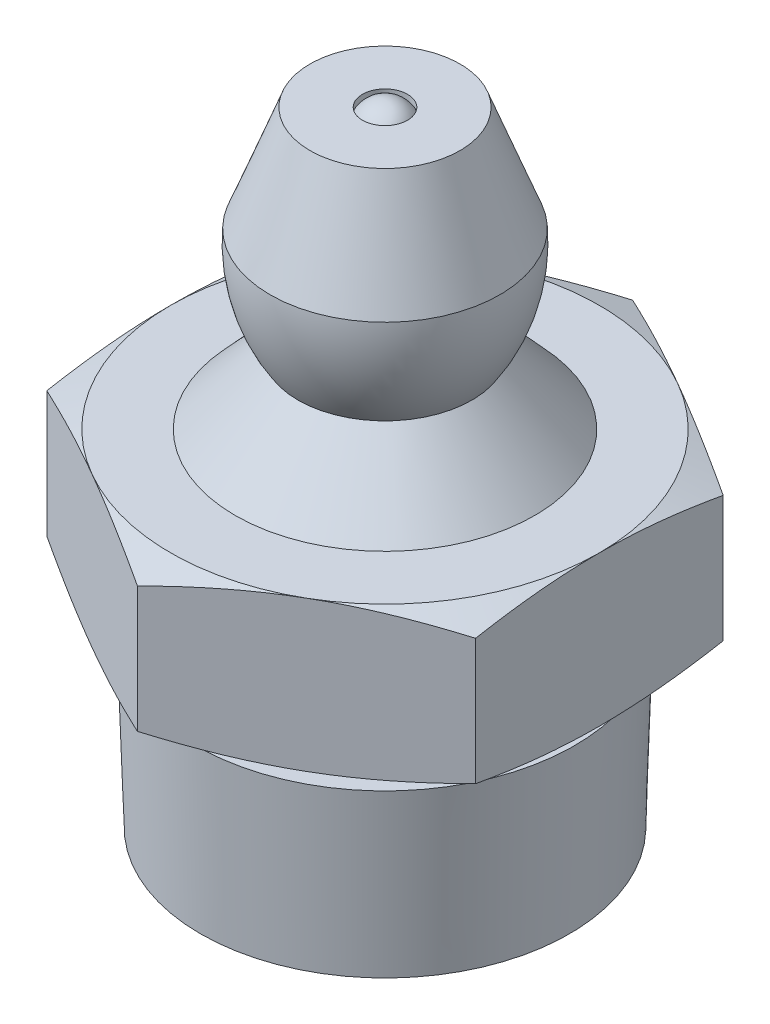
ISO-10303-21;
HEADER;
FILE_DESCRIPTION(('STEP AP214'),'2;1');
FILE_NAME('part.step','',(''),(''),'','','');
FILE_SCHEMA(('AUTOMOTIVE_DESIGN { 1 0 10303 214 1 1 1 1 }'));
ENDSEC;
DATA;
#1=APPLICATION_CONTEXT('core data for automotive mechanical design processes');
#2=APPLICATION_PROTOCOL_DEFINITION('international standard','automotive_design',2000,#1);
#3=PRODUCT_CONTEXT('',#1,'mechanical');
#4=PRODUCT('Part','Part','',(#3));
#5=PRODUCT_RELATED_PRODUCT_CATEGORY('part','',(#4));
#6=PRODUCT_DEFINITION_FORMATION('','',#4);
#7=PRODUCT_DEFINITION_CONTEXT('part definition',#1,'design');
#8=PRODUCT_DEFINITION('design','',#6,#7);
#9=PRODUCT_DEFINITION_SHAPE('','',#8);
#10=(LENGTH_UNIT() NAMED_UNIT(*) SI_UNIT(.MILLI.,.METRE.));
#11=(NAMED_UNIT(*) PLANE_ANGLE_UNIT() SI_UNIT($,.RADIAN.));
#12=(NAMED_UNIT(*) SI_UNIT($,.STERADIAN.) SOLID_ANGLE_UNIT());
#13=UNCERTAINTY_MEASURE_WITH_UNIT(LENGTH_MEASURE(1.E-05),#10,'distance_accuracy_value','');
#14=(GEOMETRIC_REPRESENTATION_CONTEXT(3) GLOBAL_UNCERTAINTY_ASSIGNED_CONTEXT((#13)) GLOBAL_UNIT_ASSIGNED_CONTEXT((#10,
#11,#12)) REPRESENTATION_CONTEXT('',''));
#15=CARTESIAN_POINT('',(0.,0.,0.));
#16=DIRECTION('',(0.,0.,1.));
#17=DIRECTION('',(1.,0.,0.));
#18=AXIS2_PLACEMENT_3D('',#15,#16,#17);
#19=CARTESIAN_POINT('',(0.,-10.,0.));
#20=DIRECTION('',(0.,1.,0.));
#21=DIRECTION('',(1.00000000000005,0.,0.));
#22=AXIS2_PLACEMENT_3D('',#19,#20,#21);
#23=CYLINDRICAL_SURFACE('',#22,0.5775);
#24=CARTESIAN_POINT('',(-2.2135071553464E-12,10.8410653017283,3.46944695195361E-13));
#25=DIRECTION('',(0.,-1.,0.));
#26=DIRECTION('',(0.,0.,-1.00000000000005));
#27=AXIS2_PLACEMENT_3D('',#24,#25,#26);
#28=CIRCLE('',#27,0.5775);
#29=CARTESIAN_POINT('',(-2.2135071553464E-12,10.8410653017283,-0.577499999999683));
#30=VERTEX_POINT('',#29);
#31=EDGE_CURVE('E20',#30,#30,#28,.T.);
#32=ORIENTED_EDGE('',*,*,#31,.T.);
#33=EDGE_LOOP('',(#32));
#34=FACE_BOUND('',#33,.T.);
#35=CARTESIAN_POINT('',(-2.2135071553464E-12,11.,3.46944695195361E-13));
#36=DIRECTION('',(0.,-1.,0.));
#37=DIRECTION('',(1.00000000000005,0.,0.));
#38=AXIS2_PLACEMENT_3D('',#35,#36,#37);
#39=CIRCLE('',#38,0.5775);
#40=CARTESIAN_POINT('',(0.577499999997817,11.,3.46944695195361E-13));
#41=VERTEX_POINT('',#40);
#42=EDGE_CURVE('E283',#41,#41,#39,.T.);
#43=ORIENTED_EDGE('',*,*,#42,.F.);
#44=EDGE_LOOP('',(#43));
#45=FACE_BOUND('',#44,.T.);
#46=ADVANCED_FACE('F16',(#34,#45),#23,.F.);
#47=CARTESIAN_POINT('',(4.73131694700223,-5.,4.83034685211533E-13));
#48=DIRECTION('',(0.,1.,0.));
#49=DIRECTION('',(0.,0.,1.00000000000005));
#50=AXIS2_PLACEMENT_3D('',#47,#48,#49);
#51=PLANE('',#50);
#52=CARTESIAN_POINT('',(0.,-5.,0.));
#53=DIRECTION('',(0.,1.,0.));
#54=DIRECTION('',(0.,0.,1.00000000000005));
#55=AXIS2_PLACEMENT_3D('',#52,#53,#54);
#56=CIRCLE('',#55,0.5775);
#57=CARTESIAN_POINT('',(0.,-5.,0.57750000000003));
#58=VERTEX_POINT('',#57);
#59=EDGE_CURVE('E281',#58,#58,#56,.T.);
#60=ORIENTED_EDGE('',*,*,#59,.T.);
#61=EDGE_LOOP('',(#60));
#62=FACE_BOUND('',#61,.T.);
#63=CARTESIAN_POINT('',(0.,-5.,0.));
#64=DIRECTION('',(0.,-1.,0.));
#65=DIRECTION('',(0.,0.,-1.00000000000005));
#66=AXIS2_PLACEMENT_3D('',#63,#64,#65);
#67=CIRCLE('',#66,4.73131694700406);
#68=CARTESIAN_POINT('',(0.,-5.,-4.7313169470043));
#69=VERTEX_POINT('',#68);
#70=EDGE_CURVE('E326',#69,#69,#67,.T.);
#71=ORIENTED_EDGE('',*,*,#70,.T.);
#72=EDGE_LOOP('',(#71));
#73=FACE_BOUND('',#72,.T.);
#74=ADVANCED_FACE('F18',(#62,#73),#51,.F.);
#75=CARTESIAN_POINT('',(0.,0.,0.));
#76=DIRECTION('',(0.,-1.,0.));
#77=DIRECTION('',(0.,0.,-1.00000000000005));
#78=AXIS2_PLACEMENT_3D('',#75,#76,#77);
#79=CYLINDRICAL_SURFACE('',#78,4.3776);
#80=CARTESIAN_POINT('',(0.,0.,0.));
#81=DIRECTION('',(0.,-1.,0.));
#82=DIRECTION('',(1.00000000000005,0.,0.));
#83=AXIS2_PLACEMENT_3D('',#80,#81,#82);
#84=CIRCLE('',#83,4.3776);
#85=CARTESIAN_POINT('',(4.37760000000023,0.,0.));
#86=VERTEX_POINT('',#85);
#87=EDGE_CURVE('E329',#86,#86,#84,.F.);
#88=ORIENTED_EDGE('',*,*,#87,.F.);
#89=EDGE_LOOP('',(#88));
#90=FACE_BOUND('',#89,.T.);
#91=CARTESIAN_POINT('',(0.,-0.750000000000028,0.));
#92=DIRECTION('',(0.,-1.,0.));
#93=DIRECTION('',(0.,0.,-1.00000000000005));
#94=AXIS2_PLACEMENT_3D('',#91,#92,#93);
#95=CIRCLE('',#94,4.3776);
#96=CARTESIAN_POINT('',(0.,-0.750000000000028,-4.37760000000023));
#97=VERTEX_POINT('',#96);
#98=EDGE_CURVE('E25',#97,#97,#95,.T.);
#99=ORIENTED_EDGE('',*,*,#98,.F.);
#100=EDGE_LOOP('',(#99));
#101=FACE_BOUND('',#100,.T.);
#102=ADVANCED_FACE('F315',(#90,#101),#79,.T.);
#103=CARTESIAN_POINT('',(4.86399999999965,-0.749999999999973,0.));
#104=DIRECTION('',(0.,1.,0.));
#105=DIRECTION('',(0.,0.,1.00000000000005));
#106=AXIS2_PLACEMENT_3D('',#103,#104,#105);
#107=PLANE('',#106);
#108=ORIENTED_EDGE('',*,*,#98,.T.);
#109=EDGE_LOOP('',(#108));
#110=FACE_BOUND('',#109,.T.);
#111=CARTESIAN_POINT('',(0.,-0.750000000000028,0.));
#112=DIRECTION('',(0.,-1.,0.));
#113=DIRECTION('',(0.,0.,-1.00000000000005));
#114=AXIS2_PLACEMENT_3D('',#111,#112,#113);
#115=CIRCLE('',#114,4.864);
#116=CARTESIAN_POINT('',(0.,-0.750000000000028,-4.86400000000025));
#117=VERTEX_POINT('',#116);
#118=EDGE_CURVE('E328',#117,#117,#115,.T.);
#119=ORIENTED_EDGE('',*,*,#118,.F.);
#120=EDGE_LOOP('',(#119));
#121=FACE_BOUND('',#120,.T.);
#122=ADVANCED_FACE('F321',(#110,#121),#107,.T.);
#123=CARTESIAN_POINT('',(0.,-5.,0.));
#124=DIRECTION('',(0.,1.,0.));
#125=DIRECTION('',(0.,0.,1.00000000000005));
#126=AXIS2_PLACEMENT_3D('',#123,#124,#125);
#127=CONICAL_SURFACE('',#126,4.73131694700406,0.0312094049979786);
#128=ORIENTED_EDGE('',*,*,#118,.T.);
#129=EDGE_LOOP('',(#128));
#130=FACE_BOUND('',#129,.T.);
#131=ORIENTED_EDGE('',*,*,#70,.F.);
#132=EDGE_LOOP('',(#131));
#133=FACE_BOUND('',#132,.T.);
#134=ADVANCED_FACE('F343',(#130,#133),#127,.T.);
#135=CARTESIAN_POINT('',(0.,0.,0.));
#136=DIRECTION('',(0.,-1.,0.));
#137=DIRECTION('',(0.,0.,1.00000000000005));
#138=AXIS2_PLACEMENT_3D('',#135,#136,#137);
#139=PLANE('',#138);
#140=ORIENTED_EDGE('',*,*,#87,.T.);
#141=EDGE_LOOP('',(#140));
#142=FACE_BOUND('',#141,.T.);
#143=CARTESIAN_POINT('',(0.,0.,0.));
#144=DIRECTION('',(0.,1.,0.));
#145=DIRECTION('',(0.,0.,1.00000000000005));
#146=AXIS2_PLACEMENT_3D('',#143,#144,#145);
#147=CIRCLE('',#146,4.95);
#148=CARTESIAN_POINT('',(0.,0.,4.95000000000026));
#149=VERTEX_POINT('',#148);
#150=EDGE_CURVE('E377',#149,#149,#147,.F.);
#151=ORIENTED_EDGE('',*,*,#150,.T.);
#152=EDGE_LOOP('',(#151));
#153=FACE_BOUND('',#152,.T.);
#154=ADVANCED_FACE('F348',(#142,#153),#139,.T.);
#155=CARTESIAN_POINT('',(0.,0.,0.));
#156=DIRECTION('',(0.,1.,0.));
#157=DIRECTION('',(1.00000000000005,0.,0.));
#158=AXIS2_PLACEMENT_3D('',#155,#156,#157);
#159=CONICAL_SURFACE('',#158,5.5,1.22173047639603);
#160=CARTESIAN_POINT('',(0.,0.,0.));
#161=DIRECTION('',(0.,1.,0.));
#162=DIRECTION('',(1.00000000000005,0.,0.));
#163=AXIS2_PLACEMENT_3D('',#160,#161,#162);
#164=CIRCLE('',#163,5.5);
#165=CARTESIAN_POINT('',(2.74999999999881,0.,4.76313972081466));
#166=VERTEX_POINT('',#165);
#167=CARTESIAN_POINT('',(5.49999999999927,0.,1.0866619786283E-13));
#168=VERTEX_POINT('',#167);
#169=EDGE_CURVE('E406',#166,#168,#164,.T.);
#170=ORIENTED_EDGE('',*,*,#169,.T.);
#171=CARTESIAN_POINT('',(5.49999999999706,1.6548520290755,8.40746986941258));
#172=CARTESIAN_POINT('',(5.49999999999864,1.57908003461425,8.15862936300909));
#173=CARTESIAN_POINT('',(5.49999999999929,1.50419218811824,7.90951462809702));
#174=CARTESIAN_POINT('',(5.49999999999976,1.35667390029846,7.41059708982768));
#175=CARTESIAN_POINT('',(5.49999999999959,1.28404363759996,7.16079423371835));
#176=CARTESIAN_POINT('',(5.49999999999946,1.14140881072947,6.65993329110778));
#177=CARTESIAN_POINT('',(5.49999999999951,1.07140939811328,6.40887373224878));
#178=CARTESIAN_POINT('',(5.49999999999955,0.934855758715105,5.9058207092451));
#179=CARTESIAN_POINT('',(5.49999999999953,0.868301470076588,5.65382726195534));
#180=CARTESIAN_POINT('',(5.49999999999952,0.740285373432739,5.15185240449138));
#181=CARTESIAN_POINT('',(5.49999999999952,0.678770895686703,4.90188449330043));
#182=CARTESIAN_POINT('',(5.49999999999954,0.560979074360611,4.40070480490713));
#183=CARTESIAN_POINT('',(5.49999999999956,0.50470181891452,4.14949300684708));
#184=CARTESIAN_POINT('',(5.49999999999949,0.398696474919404,3.64576932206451));
#185=CARTESIAN_POINT('',(5.4999999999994,0.348966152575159,3.39325790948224));
#186=CARTESIAN_POINT('',(5.49999999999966,0.257568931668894,2.88676907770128));
#187=CARTESIAN_POINT('',(5.5,0.215901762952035,2.63279170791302));
#188=CARTESIAN_POINT('',(5.49999999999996,0.146449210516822,2.15196969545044));
#189=CARTESIAN_POINT('',(5.49999999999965,0.117631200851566,1.92527561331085));
#190=CARTESIAN_POINT('',(5.49999999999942,0.0688489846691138,1.47092885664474));
#191=CARTESIAN_POINT('',(5.4999999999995,0.048884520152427,1.24327621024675));
#192=CARTESIAN_POINT('',(5.49999999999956,0.018770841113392,0.787474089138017));
#193=CARTESIAN_POINT('',(5.49999999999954,0.008614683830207,0.559325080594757));
#194=CARTESIAN_POINT('',(5.49999999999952,-0.00136817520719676,0.102798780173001));
#195=CARTESIAN_POINT('',(5.49999999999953,-0.00119494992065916,-0.125578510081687));
#196=CARTESIAN_POINT('',(5.49999999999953,0.00949859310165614,-0.583245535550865));
#197=CARTESIAN_POINT('',(5.49999999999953,0.0200713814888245,-0.81253402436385));
#198=CARTESIAN_POINT('',(5.49999999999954,0.0510774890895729,-1.27043753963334));
#199=CARTESIAN_POINT('',(5.49999999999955,0.0715110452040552,-1.49905254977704));
#200=CARTESIAN_POINT('',(5.49999999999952,0.121282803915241,-1.9554962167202));
#201=CARTESIAN_POINT('',(5.49999999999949,0.150628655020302,-2.18332402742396));
#202=CARTESIAN_POINT('',(5.49999999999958,0.217034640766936,-2.63783988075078));
#203=CARTESIAN_POINT('',(5.4999999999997,0.254094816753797,-2.86452791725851));
#204=CARTESIAN_POINT('',(5.49999999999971,0.336856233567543,-3.32869506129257));
#205=CARTESIAN_POINT('',(5.49999999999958,0.382910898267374,-3.56611059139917));
#206=CARTESIAN_POINT('',(5.49999999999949,0.480947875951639,-4.03972244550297));
#207=CARTESIAN_POINT('',(5.49999999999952,0.532930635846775,-4.27591867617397));
#208=CARTESIAN_POINT('',(5.49999999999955,0.64173215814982,-4.74726027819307));
#209=CARTESIAN_POINT('',(5.49999999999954,0.698552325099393,-4.98240532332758));
#210=CARTESIAN_POINT('',(5.49999999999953,0.816104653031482,-5.4517047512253));
#211=CARTESIAN_POINT('',(5.49999999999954,0.876836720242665,-5.68585915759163));
#212=CARTESIAN_POINT('',(5.49999999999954,1.00156020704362,-6.1536160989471));
#213=CARTESIAN_POINT('',(5.49999999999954,1.0655556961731,-6.38721754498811));
#214=CARTESIAN_POINT('',(5.49999999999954,1.1961541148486,-6.85369179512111));
#215=CARTESIAN_POINT('',(5.49999999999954,1.26275708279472,-7.08656458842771));
#216=CARTESIAN_POINT('',(5.49999999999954,1.46572941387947,-7.78417039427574));
#217=CARTESIAN_POINT('',(5.49999999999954,1.60528521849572,-8.24797568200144));
#218=CARTESIAN_POINT('',(5.49999999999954,1.88864813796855,-9.16866976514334));
#219=CARTESIAN_POINT('',(5.49999999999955,2.03239132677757,-9.62557839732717));
#220=CARTESIAN_POINT('',(5.49999999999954,2.32396390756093,-10.5381115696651));
#221=CARTESIAN_POINT('',(5.49999999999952,2.47179349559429,-10.9937360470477));
#222=CARTESIAN_POINT('',(5.49999999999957,2.76986150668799,-11.902278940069));
#223=CARTESIAN_POINT('',(5.49999999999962,2.92008866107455,-12.3552010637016));
#224=CARTESIAN_POINT('',(5.49999999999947,3.22279537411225,-13.2602511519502));
#225=CARTESIAN_POINT('',(5.49999999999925,3.37527474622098,-13.7123791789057));
#226=CARTESIAN_POINT('',(5.49999999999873,3.5285424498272,-14.1642361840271));
#227=B_SPLINE_CURVE_WITH_KNOTS('',3,(#171,#172,#173,#174,#175,#176,#177,#178,#179,#180,#181,
#182,#183,#184,#185,#186,#187,#188,#189,#190,#191,#192,#193,#194,#195,#196,#197,#198,#199,#200,
#201,#202,#203,#204,#205,#206,#207,#208,#209,#210,#211,#212,#213,#214,#215,#216,#217,#218,#219,
#220,#221,#222,#223,#224,#225,#226),.UNSPECIFIED.,.F.,.F.,(4,2,2,2,2,2,2,2,2,2,2,2,2,2,2,2,2,2,
2,2,2,2,2,2,2,2,2,4),(0.,0.780368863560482,1.56079931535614,2.34268580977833,3.12455826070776,
3.89679076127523,4.66903625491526,5.44101757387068,6.2129730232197,6.898377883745,
7.58376276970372,8.26866215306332,8.95355669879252,9.64192467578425,10.3303091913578,
11.0192861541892,11.7082668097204,12.4336976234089,13.1591831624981,13.8848800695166,
14.6105595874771,15.3371672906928,16.0637856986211,17.5167588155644,18.9536946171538,
20.3906994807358,21.8222516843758,23.2536859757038),.UNSPECIFIED.);
#228=CARTESIAN_POINT('',(5.49999999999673,0.309685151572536,3.17542648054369));
#229=VERTEX_POINT('',#228);
#230=EDGE_CURVE('E249',#168,#229,#227,.F.);
#231=ORIENTED_EDGE('',*,*,#230,.T.);
#232=CARTESIAN_POINT('',(5.50000019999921,0.309685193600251,3.17542636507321));
#233=CARTESIAN_POINT('',(5.27223305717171,0.261806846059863,3.30692778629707));
#234=CARTESIAN_POINT('',(5.04371488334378,0.218253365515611,3.43886281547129));
#235=CARTESIAN_POINT('',(4.58519282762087,0.141627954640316,3.70359064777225));
#236=CARTESIAN_POINT('',(4.35518792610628,0.1085642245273,3.83638403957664));
#237=CARTESIAN_POINT('',(3.89624469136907,0.0550846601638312,4.10135503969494));
#238=CARTESIAN_POINT('',(3.66731683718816,0.0345521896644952,4.23352659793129));
#239=CARTESIAN_POINT('',(3.20892583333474,0.00701239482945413,4.49817876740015));
#240=CARTESIAN_POINT('',(2.97946291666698,-1.34474844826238E-13,4.63065924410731));
#241=CARTESIAN_POINT('',(2.52053708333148,-1.09253803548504E-13,4.89562019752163));
#242=CARTESIAN_POINT('',(2.29107416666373,0.00701239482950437,5.0281006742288));
#243=CARTESIAN_POINT('',(1.83268316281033,0.0345521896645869,5.29275284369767));
#244=CARTESIAN_POINT('',(1.60375530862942,0.0550846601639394,5.42492440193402));
#245=CARTESIAN_POINT('',(1.14481207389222,0.108564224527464,5.6898954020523));
#246=CARTESIAN_POINT('',(0.914807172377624,0.141627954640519,5.82268879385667));
#247=CARTESIAN_POINT('',(0.456285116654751,0.218253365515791,6.08741662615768));
#248=CARTESIAN_POINT('',(0.227766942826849,0.261806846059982,6.21935165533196));
#249=CARTESIAN_POINT('',(-2.00000572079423E-07,0.309685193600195,6.350853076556));
#250=B_SPLINE_CURVE_WITH_KNOTS('',3,(#232,#233,#234,#235,#236,#237,#238,#239,#240,#241,#242,
#243,#244,#245,#246,#247,#248,#249),.UNSPECIFIED.,.F.,.F.,(4,2,2,2,2,2,2,2,4),(0.,
0.802058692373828,1.60474284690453,2.39983720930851,3.19463332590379,3.98942944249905,
4.78452380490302,5.58720795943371,6.38926665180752),.UNSPECIFIED.);
#251=EDGE_CURVE('E156',#229,#166,#250,.T.);
#252=ORIENTED_EDGE('',*,*,#251,.T.);
#253=EDGE_LOOP('',(#170,#231,#252));
#254=FACE_BOUND('',#253,.T.);
#255=ADVANCED_FACE('F353',(#254),#159,.T.);
#256=CARTESIAN_POINT('',(5.49999999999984,0.,-3.17542648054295));
#257=DIRECTION('',(0.,1.,0.));
#258=DIRECTION('',(1.00000000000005,0.,0.));
#259=AXIS2_PLACEMENT_3D('',#256,#257,#258);
#260=PLANE('',#259);
#261=ORIENTED_EDGE('',*,*,#150,.F.);
#262=EDGE_LOOP('',(#261));
#263=FACE_BOUND('',#262,.T.);
#264=CARTESIAN_POINT('',(2.74999999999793,0.,-4.76313972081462));
#265=VERTEX_POINT('',#264);
#266=EDGE_CURVE('E405',#168,#265,#164,.T.);
#267=ORIENTED_EDGE('',*,*,#266,.F.);
#268=ORIENTED_EDGE('',*,*,#169,.F.);
#269=CARTESIAN_POINT('',(-2.75000000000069,0.,4.76313972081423));
#270=VERTEX_POINT('',#269);
#271=EDGE_CURVE('E409',#270,#166,#164,.T.);
#272=ORIENTED_EDGE('',*,*,#271,.F.);
#273=CARTESIAN_POINT('',(-5.50000000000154,-1.66533453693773E-13,2.33349447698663E-13));
#274=VERTEX_POINT('',#273);
#275=EDGE_CURVE('E434',#274,#270,#164,.T.);
#276=ORIENTED_EDGE('',*,*,#275,.F.);
#277=CARTESIAN_POINT('',(0.,0.,0.));
#278=DIRECTION('',(0.,-1.,0.));
#279=DIRECTION('',(-1.00000000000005,0.,0.));
#280=AXIS2_PLACEMENT_3D('',#277,#278,#279);
#281=CIRCLE('',#280,5.5);
#282=CARTESIAN_POINT('',(-2.75000000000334,0.,-4.7631397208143));
#283=VERTEX_POINT('',#282);
#284=EDGE_CURVE('E275',#274,#283,#281,.T.);
#285=ORIENTED_EDGE('',*,*,#284,.T.);
#286=EDGE_CURVE('E436',#265,#283,#164,.T.);
#287=ORIENTED_EDGE('',*,*,#286,.F.);
#288=EDGE_LOOP('',(#267,#268,#272,#276,#285,#287));
#289=FACE_BOUND('',#288,.T.);
#290=ADVANCED_FACE('F198',(#263,#289),#260,.F.);
#291=CARTESIAN_POINT('',(-7.71287581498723E-13,0.309685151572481,6.35085296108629));
#292=VERTEX_POINT('',#291);
#293=EDGE_CURVE('E269',#166,#292,#250,.T.);
#294=ORIENTED_EDGE('',*,*,#293,.T.);
#295=CARTESIAN_POINT('',(1.99999683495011E-07,0.309685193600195,6.35085307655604));
#296=CARTESIAN_POINT('',(-0.227766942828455,0.261806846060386,6.21935165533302));
#297=CARTESIAN_POINT('',(-0.456285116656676,0.218253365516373,6.08741662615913));
#298=CARTESIAN_POINT('',(-0.914807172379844,0.141627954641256,5.82268879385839));
#299=CARTESIAN_POINT('',(-1.14481207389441,0.10856422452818,5.68989540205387));
#300=CARTESIAN_POINT('',(-1.60375530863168,0.0550846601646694,5.42492440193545));
#301=CARTESIAN_POINT('',(-1.83268316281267,0.0345521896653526,5.29275284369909));
#302=CARTESIAN_POINT('',(-2.2910741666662,0.00701239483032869,5.02810067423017));
#303=CARTESIAN_POINT('',(-2.520537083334,7.37767523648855E-13,4.89562019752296));
#304=CARTESIAN_POINT('',(-2.9794629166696,7.70791379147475E-13,4.63065924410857));
#305=CARTESIAN_POINT('',(-3.20892583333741,0.00701239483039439,4.49817876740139));
#306=CARTESIAN_POINT('',(-3.66731683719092,0.0345521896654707,4.23352659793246));
#307=CARTESIAN_POINT('',(-3.89624469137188,0.0550846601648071,4.10135503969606));
#308=CARTESIAN_POINT('',(-4.35518792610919,0.108564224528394,3.83638403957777));
#309=CARTESIAN_POINT('',(-4.58519282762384,0.141627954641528,3.70359064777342));
#310=CARTESIAN_POINT('',(-5.04371488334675,0.218253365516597,3.43886281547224));
#311=CARTESIAN_POINT('',(-5.27223305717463,0.261806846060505,3.30692778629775));
#312=CARTESIAN_POINT('',(-5.50000020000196,0.309685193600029,3.17542636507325));
#313=B_SPLINE_CURVE_WITH_KNOTS('',3,(#295,#296,#297,#298,#299,#300,#301,#302,#303,#304,#305,
#306,#307,#308,#309,#310,#311,#312),.UNSPECIFIED.,.F.,.F.,(4,2,2,2,2,2,2,2,4),(0.,
0.802058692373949,1.6047428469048,2.39983720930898,3.19463332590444,3.98942944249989,
4.78452380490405,5.58720795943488,6.3892666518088),.UNSPECIFIED.);
#314=EDGE_CURVE('E264',#292,#270,#313,.T.);
#315=ORIENTED_EDGE('',*,*,#314,.T.);
#316=ORIENTED_EDGE('',*,*,#271,.T.);
#317=EDGE_LOOP('',(#294,#315,#316));
#318=FACE_BOUND('',#317,.T.);
#319=ADVANCED_FACE('F428',(#318),#159,.T.);
#320=CARTESIAN_POINT('',(-5.50000000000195,0.309685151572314,3.17542648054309));
#321=VERTEX_POINT('',#320);
#322=EDGE_CURVE('E247',#270,#321,#313,.T.);
#323=ORIENTED_EDGE('',*,*,#322,.T.);
#324=CARTESIAN_POINT('',(-5.50000000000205,1.65485202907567,8.4074698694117));
#325=CARTESIAN_POINT('',(-5.50000000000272,1.57908003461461,8.1586293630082));
#326=CARTESIAN_POINT('',(-5.500000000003,1.5041921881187,7.90951462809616));
#327=CARTESIAN_POINT('',(-5.5000000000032,1.35667390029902,7.41059708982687));
#328=CARTESIAN_POINT('',(-5.50000000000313,1.28404363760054,7.16079423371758));
#329=CARTESIAN_POINT('',(-5.50000000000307,1.14140881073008,6.65993329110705));
#330=CARTESIAN_POINT('',(-5.5000000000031,1.07140939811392,6.40887373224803));
#331=CARTESIAN_POINT('',(-5.5000000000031,0.93485575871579,5.90582070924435));
#332=CARTESIAN_POINT('',(-5.50000000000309,0.868301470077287,5.65382726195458));
#333=CARTESIAN_POINT('',(-5.50000000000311,0.740285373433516,5.15185240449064));
#334=CARTESIAN_POINT('',(-5.50000000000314,0.67877089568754,4.90188449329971));
#335=CARTESIAN_POINT('',(-5.50000000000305,0.560979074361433,4.40070480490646));
#336=CARTESIAN_POINT('',(-5.50000000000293,0.504701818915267,4.14949300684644));
#337=CARTESIAN_POINT('',(-5.50000000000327,0.39869647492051,3.64576932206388));
#338=CARTESIAN_POINT('',(-5.50000000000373,0.348966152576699,3.39325790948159));
#339=CARTESIAN_POINT('',(-5.50000000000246,0.257568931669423,2.88676907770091));
#340=CARTESIAN_POINT('',(-5.50000000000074,0.21590176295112,2.63279170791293));
#341=CARTESIAN_POINT('',(-5.50000000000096,0.146449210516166,2.15196969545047));
#342=CARTESIAN_POINT('',(-5.50000000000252,0.117631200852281,1.92527561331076));
#343=CARTESIAN_POINT('',(-5.50000000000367,0.0688489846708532,1.4709288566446));
#344=CARTESIAN_POINT('',(-5.50000000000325,0.0488845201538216,1.24327621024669));
#345=CARTESIAN_POINT('',(-5.50000000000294,0.0187708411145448,0.787474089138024));
#346=CARTESIAN_POINT('',(-5.50000000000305,0.00861468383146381,0.559325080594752));
#347=CARTESIAN_POINT('',(-5.50000000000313,-0.00136817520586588,0.102798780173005));
#348=CARTESIAN_POINT('',(-5.50000000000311,-0.00119494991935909,-0.125578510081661));
#349=CARTESIAN_POINT('',(-5.50000000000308,0.0094985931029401,-0.583245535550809));
#350=CARTESIAN_POINT('',(-5.50000000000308,0.020071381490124,-0.812534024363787));
#351=CARTESIAN_POINT('',(-5.5000000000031,0.051077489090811,-1.27043753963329));
#352=CARTESIAN_POINT('',(-5.50000000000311,0.071511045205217,-1.49905254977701));
#353=CARTESIAN_POINT('',(-5.50000000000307,0.121282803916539,-1.95549621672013));
#354=CARTESIAN_POINT('',(-5.50000000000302,0.150628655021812,-2.18332402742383));
#355=CARTESIAN_POINT('',(-5.50000000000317,0.217034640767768,-2.63783988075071));
#356=CARTESIAN_POINT('',(-5.50000000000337,0.25409481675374,-2.86452791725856));
#357=CARTESIAN_POINT('',(-5.50000000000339,0.336856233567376,-3.32869506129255));
#358=CARTESIAN_POINT('',(-5.50000000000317,0.382910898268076,-3.56611059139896));
#359=CARTESIAN_POINT('',(-5.50000000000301,0.480947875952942,-4.03972244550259));
#360=CARTESIAN_POINT('',(-5.50000000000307,0.532930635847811,-4.27591867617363));
#361=CARTESIAN_POINT('',(-5.50000000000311,0.641732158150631,-4.74726027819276));
#362=CARTESIAN_POINT('',(-5.50000000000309,0.698552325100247,-4.98240532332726));
#363=CARTESIAN_POINT('',(-5.50000000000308,0.816104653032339,-5.45170475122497));
#364=CARTESIAN_POINT('',(-5.50000000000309,0.876836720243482,-5.68585915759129));
#365=CARTESIAN_POINT('',(-5.50000000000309,1.00156020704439,-6.15361609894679));
#366=CARTESIAN_POINT('',(-5.50000000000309,1.06555569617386,-6.38721754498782));
#367=CARTESIAN_POINT('',(-5.50000000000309,1.19615411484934,-6.85369179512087));
#368=CARTESIAN_POINT('',(-5.50000000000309,1.26275708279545,-7.0865645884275));
#369=CARTESIAN_POINT('',(-5.50000000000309,1.46572941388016,-7.78417039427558));
#370=CARTESIAN_POINT('',(-5.50000000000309,1.6052852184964,-8.24797568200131));
#371=CARTESIAN_POINT('',(-5.50000000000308,1.88864813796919,-9.16866976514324));
#372=CARTESIAN_POINT('',(-5.50000000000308,2.03239132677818,-9.62557839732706));
#373=CARTESIAN_POINT('',(-5.50000000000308,2.32396390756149,-10.538111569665));
#374=CARTESIAN_POINT('',(-5.50000000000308,2.47179349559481,-10.9937360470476));
#375=CARTESIAN_POINT('',(-5.50000000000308,2.76986150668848,-11.9022789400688));
#376=CARTESIAN_POINT('',(-5.50000000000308,2.92008866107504,-12.3552010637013));
#377=CARTESIAN_POINT('',(-5.50000000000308,3.22279537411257,-13.2602511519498));
#378=CARTESIAN_POINT('',(-5.50000000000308,3.37527474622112,-13.7123791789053));
#379=CARTESIAN_POINT('',(-5.50000000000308,3.52854244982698,-14.1642361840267));
#380=B_SPLINE_CURVE_WITH_KNOTS('',3,(#324,#325,#326,#327,#328,#329,#330,#331,#332,#333,#334,
#335,#336,#337,#338,#339,#340,#341,#342,#343,#344,#345,#346,#347,#348,#349,#350,#351,#352,#353,
#354,#355,#356,#357,#358,#359,#360,#361,#362,#363,#364,#365,#366,#367,#368,#369,#370,#371,#372,
#373,#374,#375,#376,#377,#378,#379),.UNSPECIFIED.,.F.,.F.,(4,2,2,2,2,2,2,2,2,2,2,2,2,2,2,2,2,2,
2,2,2,2,2,2,2,2,2,4),(0.,0.780368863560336,1.56079931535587,2.34268580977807,3.12455826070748,
3.89679076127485,4.66903625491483,5.44101757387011,6.21297302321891,6.89837788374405,
7.58376276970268,8.26866215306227,8.95355669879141,9.64192467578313,10.3303091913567,
11.0192861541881,11.7082668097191,12.4336976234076,13.1591831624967,13.8848800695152,
14.6105595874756,15.3371672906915,16.0637856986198,17.5167588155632,18.9536946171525,
20.3906994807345,21.8222516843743,23.253685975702),.UNSPECIFIED.);
#381=EDGE_CURVE('E242',#321,#274,#380,.T.);
#382=ORIENTED_EDGE('',*,*,#381,.T.);
#383=ORIENTED_EDGE('',*,*,#275,.T.);
#384=EDGE_LOOP('',(#323,#382,#383));
#385=FACE_BOUND('',#384,.T.);
#386=ADVANCED_FACE('F451',(#385),#159,.T.);
#387=CARTESIAN_POINT('',(-5.50000000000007,0.309685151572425,-3.17542648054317));
#388=VERTEX_POINT('',#387);
#389=EDGE_CURVE('E248',#274,#388,#380,.T.);
#390=ORIENTED_EDGE('',*,*,#389,.T.);
#391=CARTESIAN_POINT('',(-5.50000020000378,0.309685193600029,-3.17542636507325));
#392=CARTESIAN_POINT('',(-5.27223305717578,0.261806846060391,-3.30692778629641));
#393=CARTESIAN_POINT('',(-5.04371488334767,0.218253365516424,-3.43886281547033));
#394=CARTESIAN_POINT('',(-4.58519282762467,0.14162795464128,-3.70359064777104));
#395=CARTESIAN_POINT('',(-4.35518792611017,0.108564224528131,-3.83638403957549));
#396=CARTESIAN_POINT('',(-3.89624469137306,0.0550846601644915,-4.10135503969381));
#397=CARTESIAN_POINT('',(-3.66731683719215,0.0345521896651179,-4.23352659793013));
#398=CARTESIAN_POINT('',(-3.20892583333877,0.00701239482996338,-4.49817876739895));
#399=CARTESIAN_POINT('',(-2.97946291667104,2.98890996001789E-13,-4.6306592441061));
#400=CARTESIAN_POINT('',(-2.52053708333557,1.72411688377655E-13,-4.89562019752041));
#401=CARTESIAN_POINT('',(-2.29107416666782,0.00701239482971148,-5.02810067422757));
#402=CARTESIAN_POINT('',(-1.83268316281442,0.0345521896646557,-5.29275284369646));
#403=CARTESIAN_POINT('',(-1.60375530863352,0.0550846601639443,-5.42492440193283));
#404=CARTESIAN_POINT('',(-1.14481207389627,0.108564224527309,-5.68989540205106));
#405=CARTESIAN_POINT('',(-0.914807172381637,0.141627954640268,-5.82268879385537));
#406=CARTESIAN_POINT('',(-0.456285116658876,0.218253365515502,-6.08741662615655));
#407=CARTESIAN_POINT('',(-0.22776694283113,0.261806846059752,-6.21935165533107));
#408=CARTESIAN_POINT('',(1.99995908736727E-07,0.309685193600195,-6.35085307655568));
#409=B_SPLINE_CURVE_WITH_KNOTS('',3,(#391,#392,#393,#394,#395,#396,#397,#398,#399,#400,#401,
#402,#403,#404,#405,#406,#407,#408),.UNSPECIFIED.,.F.,.F.,(4,2,2,2,2,2,2,2,4),(0.,
0.802058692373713,1.60474284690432,2.39983720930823,3.19463332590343,3.98942944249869,
4.78452380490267,5.58720795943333,6.38926665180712),.UNSPECIFIED.);
#410=EDGE_CURVE('E167',#388,#283,#409,.T.);
#411=ORIENTED_EDGE('',*,*,#410,.T.);
#412=ORIENTED_EDGE('',*,*,#284,.F.);
#413=EDGE_LOOP('',(#390,#411,#412));
#414=FACE_BOUND('',#413,.T.);
#415=ADVANCED_FACE('F195',(#414),#159,.T.);
#416=ORIENTED_EDGE('',*,*,#286,.T.);
#417=CARTESIAN_POINT('',(-1.10370396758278E-12,0.309685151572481,-6.35085296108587));
#418=VERTEX_POINT('',#417);
#419=EDGE_CURVE('E174',#283,#418,#409,.T.);
#420=ORIENTED_EDGE('',*,*,#419,.T.);
#421=CARTESIAN_POINT('',(-2.00001481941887E-07,0.309685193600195,-6.35085307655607));
#422=CARTESIAN_POINT('',(0.227766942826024,0.261806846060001,-6.21935165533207));
#423=CARTESIAN_POINT('',(0.456285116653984,0.218253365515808,-6.08741662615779));
#424=CARTESIAN_POINT('',(0.914807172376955,0.141627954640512,-5.82268879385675));
#425=CARTESIAN_POINT('',(1.14481207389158,0.108564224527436,-5.68989540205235));
#426=CARTESIAN_POINT('',(1.60375530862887,0.0550846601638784,-5.42492440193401));
#427=CARTESIAN_POINT('',(1.83268316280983,0.0345521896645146,-5.29275284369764));
#428=CARTESIAN_POINT('',(2.29107416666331,0.0070123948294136,-5.02810067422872));
#429=CARTESIAN_POINT('',(2.5205370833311,-2.07116615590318E-13,-4.89562019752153));
#430=CARTESIAN_POINT('',(2.97946291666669,-2.40658881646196E-13,-4.63065924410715));
#431=CARTESIAN_POINT('',(3.20892583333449,0.0070123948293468,-4.49817876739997));
#432=CARTESIAN_POINT('',(3.667316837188,0.034552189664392,-4.23352659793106));
#433=CARTESIAN_POINT('',(3.89624469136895,0.0550846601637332,-4.10135503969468));
#434=CARTESIAN_POINT('',(4.35518792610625,0.108564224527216,-3.83638403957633));
#435=CARTESIAN_POINT('',(4.58519282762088,0.141627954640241,-3.7035906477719));
#436=CARTESIAN_POINT('',(5.04371488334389,0.218253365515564,-3.43886281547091));
#437=CARTESIAN_POINT('',(5.27223305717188,0.261806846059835,-3.30692778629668));
#438=CARTESIAN_POINT('',(5.50000019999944,0.309685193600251,-3.17542636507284));
#439=B_SPLINE_CURVE_WITH_KNOTS('',3,(#421,#422,#423,#424,#425,#426,#427,#428,#429,#430,#431,
#432,#433,#434,#435,#436,#437,#438),.UNSPECIFIED.,.F.,.F.,(4,2,2,2,2,2,2,2,4),(0.,
0.802058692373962,1.6047428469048,2.39983720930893,3.19463332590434,3.98942944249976,
4.7845238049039,5.58720795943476,6.38926665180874),.UNSPECIFIED.);
#440=EDGE_CURVE('E241',#418,#265,#439,.T.);
#441=ORIENTED_EDGE('',*,*,#440,.T.);
#442=EDGE_LOOP('',(#416,#420,#441));
#443=FACE_BOUND('',#442,.T.);
#444=ADVANCED_FACE('F485',(#443),#159,.T.);
#445=ORIENTED_EDGE('',*,*,#266,.T.);
#446=CARTESIAN_POINT('',(5.49999999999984,0.309685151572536,-3.17542648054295));
#447=VERTEX_POINT('',#446);
#448=EDGE_CURVE('E235',#265,#447,#439,.T.);
#449=ORIENTED_EDGE('',*,*,#448,.T.);
#450=EDGE_CURVE('E449',#447,#168,#227,.F.);
#451=ORIENTED_EDGE('',*,*,#450,.T.);
#452=EDGE_LOOP('',(#445,#449,#451));
#453=FACE_BOUND('',#452,.T.);
#454=ADVANCED_FACE('F447',(#453),#159,.T.);
#455=CARTESIAN_POINT('',(5.49999999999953,3.85000000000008,3.17542648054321));
#456=DIRECTION('',(-1.00000000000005,0.,0.));
#457=DIRECTION('',(0.,0.,1.00000000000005));
#458=AXIS2_PLACEMENT_3D('',#455,#456,#457);
#459=PLANE('',#458);
#460=DIRECTION('',(0.,-1.,0.));
#461=VECTOR('',#460,1.);
#462=CARTESIAN_POINT('',(5.49999999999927,0.,1.0866619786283E-13));
#463=LINE('',#462,#461);
#464=CARTESIAN_POINT('',(5.49999999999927,2.03500000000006,1.08801233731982E-13));
#465=VERTEX_POINT('',#464);
#466=CARTESIAN_POINT('',(5.49999999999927,0.385000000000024,1.08691745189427E-13));
#467=VERTEX_POINT('',#466);
#468=EDGE_CURVE('E31',#465,#467,#463,.T.);
#469=ORIENTED_EDGE('',*,*,#468,.T.);
#470=ORIENTED_EDGE('',*,*,#468,.F.);
#471=EDGE_LOOP('',(#469,#470));
#472=FACE_BOUND('',#471,.T.);
#473=DIRECTION('',(0.,-1.,0.));
#474=VECTOR('',#473,1.);
#475=CARTESIAN_POINT('',(5.49999999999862,3.85000000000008,-3.17542648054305));
#476=LINE('',#475,#474);
#477=CARTESIAN_POINT('',(5.49999999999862,3.54031484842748,-3.17542648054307));
#478=VERTEX_POINT('',#477);
#479=EDGE_CURVE('E410',#478,#447,#476,.T.);
#480=ORIENTED_EDGE('',*,*,#479,.F.);
#481=CARTESIAN_POINT('',(5.49999999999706,2.19514797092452,8.40746986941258));
#482=CARTESIAN_POINT('',(5.49999999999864,2.27091996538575,8.1586293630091));
#483=CARTESIAN_POINT('',(5.49999999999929,2.34580781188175,7.90951462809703));
#484=CARTESIAN_POINT('',(5.49999999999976,2.49332609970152,7.4105970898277));
#485=CARTESIAN_POINT('',(5.49999999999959,2.56595636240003,7.16079423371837));
#486=CARTESIAN_POINT('',(5.49999999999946,2.70859118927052,6.65993329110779));
#487=CARTESIAN_POINT('',(5.49999999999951,2.77859060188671,6.40887373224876));
#488=CARTESIAN_POINT('',(5.49999999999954,2.9151442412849,5.90582070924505));
#489=CARTESIAN_POINT('',(5.49999999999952,2.98169852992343,5.65382726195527));
#490=CARTESIAN_POINT('',(5.49999999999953,3.10971462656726,5.15185240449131));
#491=CARTESIAN_POINT('',(5.49999999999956,3.17122910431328,4.90188449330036));
#492=CARTESIAN_POINT('',(5.49999999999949,3.28902092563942,4.40070480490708));
#493=CARTESIAN_POINT('',(5.49999999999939,3.34529818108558,4.14949300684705));
#494=CARTESIAN_POINT('',(5.49999999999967,3.4513035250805,3.64576932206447));
#495=CARTESIAN_POINT('',(5.50000000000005,3.50103384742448,3.39325790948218));
#496=CARTESIAN_POINT('',(5.49999999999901,3.59243106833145,2.88676907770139));
#497=CARTESIAN_POINT('',(5.4999999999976,3.63409823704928,2.6327917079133));
#498=CARTESIAN_POINT('',(5.49999999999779,3.70355078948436,2.15196969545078));
#499=CARTESIAN_POINT('',(5.49999999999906,3.73236879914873,1.92527561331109));
#500=CARTESIAN_POINT('',(5.5,3.78115101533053,1.47092885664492));
#501=CARTESIAN_POINT('',(5.49999999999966,3.80111547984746,1.24327621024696));
#502=CARTESIAN_POINT('',(5.49999999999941,3.83122915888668,0.787474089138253));
#503=CARTESIAN_POINT('',(5.4999999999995,3.8413853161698,0.559325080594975));
#504=CARTESIAN_POINT('',(5.49999999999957,3.85136817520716,0.102798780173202));
#505=CARTESIAN_POINT('',(5.49999999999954,3.85119494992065,-0.125578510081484));
#506=CARTESIAN_POINT('',(5.49999999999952,3.84050140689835,-0.583245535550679));
#507=CARTESIAN_POINT('',(5.49999999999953,3.82992861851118,-0.812534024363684));
#508=CARTESIAN_POINT('',(5.49999999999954,3.79892251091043,-1.27043753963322));
#509=CARTESIAN_POINT('',(5.49999999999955,3.77848895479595,-1.49905254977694));
#510=CARTESIAN_POINT('',(5.49999999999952,3.72871719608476,-1.95549621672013));
#511=CARTESIAN_POINT('',(5.49999999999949,3.69937134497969,-2.1833240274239));
#512=CARTESIAN_POINT('',(5.49999999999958,3.63296535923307,-2.63783988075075));
#513=CARTESIAN_POINT('',(5.4999999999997,3.59590518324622,-2.86452791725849));
#514=CARTESIAN_POINT('',(5.49999999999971,3.51314376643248,-3.32869506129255));
#515=CARTESIAN_POINT('',(5.49999999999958,3.46708910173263,-3.56611059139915));
#516=CARTESIAN_POINT('',(5.49999999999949,3.36905212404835,-4.03972244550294));
#517=CARTESIAN_POINT('',(5.49999999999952,3.31706936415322,-4.27591867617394));
#518=CARTESIAN_POINT('',(5.49999999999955,3.20826784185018,-4.74726027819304));
#519=CARTESIAN_POINT('',(5.49999999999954,3.15144767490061,-4.98240532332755));
#520=CARTESIAN_POINT('',(5.49999999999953,3.03389534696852,-5.45170475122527));
#521=CARTESIAN_POINT('',(5.49999999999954,2.97316327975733,-5.6858591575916));
#522=CARTESIAN_POINT('',(5.49999999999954,2.84843979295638,-6.15361609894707));
#523=CARTESIAN_POINT('',(5.49999999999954,2.7844443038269,-6.38721754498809));
#524=CARTESIAN_POINT('',(5.49999999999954,2.65384588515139,-6.85369179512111));
#525=CARTESIAN_POINT('',(5.49999999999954,2.58724291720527,-7.08656458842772));
#526=CARTESIAN_POINT('',(5.49999999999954,2.38427058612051,-7.78417039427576));
#527=CARTESIAN_POINT('',(5.49999999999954,2.24471478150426,-8.24797568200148));
#528=CARTESIAN_POINT('',(5.49999999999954,1.96135186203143,-9.16866976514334));
#529=CARTESIAN_POINT('',(5.49999999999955,1.81760867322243,-9.62557839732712));
#530=CARTESIAN_POINT('',(5.49999999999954,1.5260360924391,-10.5381115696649));
#531=CARTESIAN_POINT('',(5.49999999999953,1.37820650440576,-10.9937360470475));
#532=CARTESIAN_POINT('',(5.49999999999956,1.0801384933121,-11.9022789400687));
#533=CARTESIAN_POINT('',(5.49999999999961,0.929911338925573,-12.3552010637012));
#534=CARTESIAN_POINT('',(5.49999999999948,0.627204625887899,-13.2602511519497));
#535=CARTESIAN_POINT('',(5.4999999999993,0.474725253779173,-13.7123791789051));
#536=CARTESIAN_POINT('',(5.49999999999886,0.321457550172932,-14.1642361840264));
#537=B_SPLINE_CURVE_WITH_KNOTS('',3,(#481,#482,#483,#484,#485,#486,#487,#488,#489,#490,#491,
#492,#493,#494,#495,#496,#497,#498,#499,#500,#501,#502,#503,#504,#505,#506,#507,#508,#509,#510,
#511,#512,#513,#514,#515,#516,#517,#518,#519,#520,#521,#522,#523,#524,#525,#526,#527,#528,#529,
#530,#531,#532,#533,#534,#535,#536),.UNSPECIFIED.,.F.,.F.,(4,2,2,2,2,2,2,2,2,2,2,2,2,2,2,2,2,2,
2,2,2,2,2,2,2,2,2,4),(0.,0.780368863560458,1.56079931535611,2.34268580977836,3.12455826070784,
3.89679076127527,4.6690362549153,5.44101757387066,6.21297302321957,6.89837788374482,
7.58376276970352,8.26866215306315,8.95355669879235,9.64192467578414,10.3303091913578,
11.0192861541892,11.7082668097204,12.4336976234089,13.1591831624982,13.8848800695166,
14.6105595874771,15.3371672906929,16.0637856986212,17.5167588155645,18.9536946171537,
20.3906994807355,21.8222516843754,23.2536859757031),.UNSPECIFIED.);
#538=CARTESIAN_POINT('',(5.49999999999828,3.85000000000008,2.33604920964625E-13));
#539=VERTEX_POINT('',#538);
#540=EDGE_CURVE('E144',#478,#539,#537,.F.);
#541=ORIENTED_EDGE('',*,*,#540,.T.);
#542=CARTESIAN_POINT('',(5.49999999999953,3.54031484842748,3.17542648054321));
#543=VERTEX_POINT('',#542);
#544=EDGE_CURVE('E137',#539,#543,#537,.F.);
#545=ORIENTED_EDGE('',*,*,#544,.T.);
#546=DIRECTION('',(0.,-1.,0.));
#547=VECTOR('',#546,1.);
#548=CARTESIAN_POINT('',(5.49999999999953,3.85000000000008,3.17542648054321));
#549=LINE('',#548,#547);
#550=EDGE_CURVE('E141',#543,#229,#549,.T.);
#551=ORIENTED_EDGE('',*,*,#550,.T.);
#552=ORIENTED_EDGE('',*,*,#230,.F.);
#553=ORIENTED_EDGE('',*,*,#450,.F.);
#554=EDGE_LOOP('',(#480,#541,#545,#551,#552,#553));
#555=FACE_BOUND('',#554,.T.);
#556=ADVANCED_FACE('F140',(#472,#555),#459,.F.);
#557=CARTESIAN_POINT('',(5.49999999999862,3.85000000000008,-3.17542648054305));
#558=DIRECTION('',(-0.500000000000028,0.,0.866025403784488));
#559=DIRECTION('',(0.866025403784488,0.,0.500000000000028));
#560=AXIS2_PLACEMENT_3D('',#557,#558,#559);
#561=PLANE('',#560);
#562=DIRECTION('',(0.,-1.,0.));
#563=VECTOR('',#562,1.);
#564=CARTESIAN_POINT('',(2.74999999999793,0.,-4.76313972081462));
#565=LINE('',#564,#563);
#566=CARTESIAN_POINT('',(2.74999999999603,2.03500000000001,-4.76313972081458));
#567=VERTEX_POINT('',#566);
#568=CARTESIAN_POINT('',(2.74999999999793,0.384999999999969,-4.76313972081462));
#569=VERTEX_POINT('',#568);
#570=EDGE_CURVE('E391',#567,#569,#565,.T.);
#571=ORIENTED_EDGE('',*,*,#570,.T.);
#572=ORIENTED_EDGE('',*,*,#570,.F.);
#573=EDGE_LOOP('',(#571,#572));
#574=FACE_BOUND('',#573,.T.);
#575=DIRECTION('',(0.,-1.,0.));
#576=VECTOR('',#575,1.);
#577=CARTESIAN_POINT('',(-1.22031862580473E-12,3.84999999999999,-6.35085296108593));
#578=LINE('',#577,#576);
#579=CARTESIAN_POINT('',(-4.44519251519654E-12,3.54031484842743,-6.35085296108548));
#580=VERTEX_POINT('',#579);
#581=EDGE_CURVE('E413',#580,#418,#578,.T.);
#582=ORIENTED_EDGE('',*,*,#581,.F.);
#583=CARTESIAN_POINT('',(-2.00002146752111E-07,3.54031480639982,-6.35085307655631));
#584=CARTESIAN_POINT('',(0.227766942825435,3.58819315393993,-6.21935165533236));
#585=CARTESIAN_POINT('',(0.456285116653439,3.6317466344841,-6.08741662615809));
#586=CARTESIAN_POINT('',(0.914807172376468,3.70837204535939,-5.82268879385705));
#587=CARTESIAN_POINT('',(1.14481207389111,3.74143577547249,-5.68989540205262));
#588=CARTESIAN_POINT('',(1.60375530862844,3.79491533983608,-5.42492440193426));
#589=CARTESIAN_POINT('',(1.83268316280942,3.81544781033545,-5.29275284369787));
#590=CARTESIAN_POINT('',(2.29107416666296,3.84298760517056,-5.02810067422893));
#591=CARTESIAN_POINT('',(2.52053708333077,3.85000000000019,-4.89562019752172));
#592=CARTESIAN_POINT('',(2.9794629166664,3.85000000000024,-4.63065924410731));
#593=CARTESIAN_POINT('',(3.20892583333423,3.84298760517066,-4.49817876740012));
#594=CARTESIAN_POINT('',(3.66731683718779,3.81544781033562,-4.23352659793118));
#595=CARTESIAN_POINT('',(3.89624469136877,3.79491533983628,-4.10135503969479));
#596=CARTESIAN_POINT('',(4.35518792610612,3.74143577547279,-3.8363840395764));
#597=CARTESIAN_POINT('',(4.58519282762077,3.70837204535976,-3.70359064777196));
#598=CARTESIAN_POINT('',(5.04371488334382,3.63174663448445,-3.43886281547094));
#599=CARTESIAN_POINT('',(5.27223305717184,3.58819315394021,-3.3069277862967));
#600=CARTESIAN_POINT('',(5.50000019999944,3.54031480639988,-3.17542636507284));
#601=B_SPLINE_CURVE_WITH_KNOTS('',3,(#583,#584,#585,#586,#587,#588,#589,#590,#591,#592,#593,
#594,#595,#596,#597,#598,#599,#600),.UNSPECIFIED.,.F.,.F.,(4,2,2,2,2,2,2,2,4),(0.,
0.802058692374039,1.60474284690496,2.39983720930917,3.19463332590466,3.98942944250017,
4.7845238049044,5.58720795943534,6.3892666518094),.UNSPECIFIED.);
#602=CARTESIAN_POINT('',(2.74999999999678,3.84999999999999,-4.76313972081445));
#603=VERTEX_POINT('',#602);
#604=EDGE_CURVE('E221',#580,#603,#601,.T.);
#605=ORIENTED_EDGE('',*,*,#604,.T.);
#606=EDGE_CURVE('E216',#603,#478,#601,.T.);
#607=ORIENTED_EDGE('',*,*,#606,.T.);
#608=ORIENTED_EDGE('',*,*,#479,.T.);
#609=ORIENTED_EDGE('',*,*,#448,.F.);
#610=ORIENTED_EDGE('',*,*,#440,.F.);
#611=EDGE_LOOP('',(#582,#605,#607,#608,#609,#610));
#612=FACE_BOUND('',#611,.T.);
#613=ADVANCED_FACE('F226',(#574,#612),#561,.F.);
#614=CARTESIAN_POINT('',(-1.22031862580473E-12,3.84999999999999,-6.35085296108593));
#615=DIRECTION('',(0.500000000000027,0.,0.86602540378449));
#616=DIRECTION('',(0.866025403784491,0.,-0.500000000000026));
#617=AXIS2_PLACEMENT_3D('',#614,#615,#616);
#618=PLANE('',#617);
#619=DIRECTION('',(0.,-1.,0.));
#620=VECTOR('',#619,1.);
#621=CARTESIAN_POINT('',(-2.75000000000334,0.,-4.7631397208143));
#622=LINE('',#621,#620);
#623=CARTESIAN_POINT('',(-2.75000000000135,2.03500000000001,-4.76313972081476));
#624=VERTEX_POINT('',#623);
#625=CARTESIAN_POINT('',(-2.75000000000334,0.384999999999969,-4.7631397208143));
#626=VERTEX_POINT('',#625);
#627=EDGE_CURVE('E393',#624,#626,#622,.T.);
#628=ORIENTED_EDGE('',*,*,#627,.T.);
#629=ORIENTED_EDGE('',*,*,#627,.F.);
#630=EDGE_LOOP('',(#628,#629));
#631=FACE_BOUND('',#630,.T.);
#632=DIRECTION('',(0.,-1.,0.));
#633=VECTOR('',#632,1.);
#634=CARTESIAN_POINT('',(-5.50000000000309,3.84999999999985,-3.1754264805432));
#635=LINE('',#634,#633);
#636=CARTESIAN_POINT('',(-5.50000000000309,3.54031484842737,-3.1754264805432));
#637=VERTEX_POINT('',#636);
#638=EDGE_CURVE('E416',#637,#388,#635,.T.);
#639=ORIENTED_EDGE('',*,*,#638,.F.);
#640=CARTESIAN_POINT('',(-5.50000020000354,3.54031480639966,-3.17542636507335));
#641=CARTESIAN_POINT('',(-5.27223305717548,3.58819315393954,-3.30692778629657));
#642=CARTESIAN_POINT('',(-5.04371488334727,3.63174663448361,-3.43886281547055));
#643=CARTESIAN_POINT('',(-4.58519282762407,3.70837204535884,-3.70359064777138));
#644=CARTESIAN_POINT('',(-4.35518792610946,3.74143577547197,-3.8363840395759));
#645=CARTESIAN_POINT('',(-3.89624469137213,3.79491533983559,-4.10135503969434));
#646=CARTESIAN_POINT('',(-3.66731683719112,3.81544781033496,-4.23352659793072));
#647=CARTESIAN_POINT('',(-3.20892583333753,3.84298760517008,-4.49817876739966));
#648=CARTESIAN_POINT('',(-2.97946291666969,3.84999999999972,-4.63065924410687));
#649=CARTESIAN_POINT('',(-2.52053708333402,3.84999999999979,-4.8956201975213));
#650=CARTESIAN_POINT('',(-2.29107416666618,3.84298760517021,-5.02810067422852));
#651=CARTESIAN_POINT('',(-1.83268316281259,3.8154478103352,-5.29275284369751));
#652=CARTESIAN_POINT('',(-1.60375530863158,3.79491533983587,-5.42492440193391));
#653=CARTESIAN_POINT('',(-1.14481207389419,3.74143577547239,-5.68989540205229));
#654=CARTESIAN_POINT('',(-0.914807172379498,3.70837204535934,-5.82268879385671));
#655=CARTESIAN_POINT('',(-0.456285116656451,3.63174663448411,-6.08741662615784));
#656=CARTESIAN_POINT('',(-0.22776694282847,3.58819315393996,-6.21935165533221));
#657=CARTESIAN_POINT('',(1.99999017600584E-07,3.54031480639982,-6.35085307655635));
#658=B_SPLINE_CURVE_WITH_KNOTS('',3,(#640,#641,#642,#643,#644,#645,#646,#647,#648,#649,#650,
#651,#652,#653,#654,#655,#656,#657),.UNSPECIFIED.,.F.,.F.,(4,2,2,2,2,2,2,2,4),(0.,
0.802058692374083,1.60474284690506,2.39983720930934,3.1946333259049,3.98942944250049,
4.78452380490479,5.58720795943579,6.3892666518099),.UNSPECIFIED.);
#659=CARTESIAN_POINT('',(-2.75000000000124,3.84999999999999,-4.76313972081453));
#660=VERTEX_POINT('',#659);
#661=EDGE_CURVE('E158',#637,#660,#658,.T.);
#662=ORIENTED_EDGE('',*,*,#661,.T.);
#663=EDGE_CURVE('E222',#660,#580,#658,.T.);
#664=ORIENTED_EDGE('',*,*,#663,.T.);
#665=ORIENTED_EDGE('',*,*,#581,.T.);
#666=ORIENTED_EDGE('',*,*,#419,.F.);
#667=ORIENTED_EDGE('',*,*,#410,.F.);
#668=EDGE_LOOP('',(#639,#662,#664,#665,#666,#667));
#669=FACE_BOUND('',#668,.T.);
#670=ADVANCED_FACE('F229',(#631,#669),#618,.F.);
#671=CARTESIAN_POINT('',(-5.50000000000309,3.84999999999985,-3.1754264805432));
#672=DIRECTION('',(1.00000000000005,0.,0.));
#673=DIRECTION('',(0.,0.,-1.00000000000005));
#674=AXIS2_PLACEMENT_3D('',#671,#672,#673);
#675=PLANE('',#674);
#676=DIRECTION('',(0.,-1.,0.));
#677=VECTOR('',#676,1.);
#678=CARTESIAN_POINT('',(-5.50000000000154,-1.66533453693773E-13,2.33349447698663E-13));
#679=LINE('',#678,#677);
#680=CARTESIAN_POINT('',(-5.50000000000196,2.03499999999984,0.));
#681=VERTEX_POINT('',#680);
#682=CARTESIAN_POINT('',(-5.50000000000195,0.384999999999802,0.));
#683=VERTEX_POINT('',#682);
#684=EDGE_CURVE('E395',#681,#683,#679,.T.);
#685=ORIENTED_EDGE('',*,*,#684,.T.);
#686=ORIENTED_EDGE('',*,*,#684,.F.);
#687=EDGE_LOOP('',(#685,#686));
#688=FACE_BOUND('',#687,.T.);
#689=DIRECTION('',(0.,-1.,0.));
#690=VECTOR('',#689,1.);
#691=CARTESIAN_POINT('',(-5.5000000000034,3.84999999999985,3.17542648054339));
#692=LINE('',#691,#690);
#693=CARTESIAN_POINT('',(-5.5000000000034,3.54031484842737,3.17542648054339));
#694=VERTEX_POINT('',#693);
#695=EDGE_CURVE('E419',#694,#321,#692,.T.);
#696=ORIENTED_EDGE('',*,*,#695,.F.);
#697=CARTESIAN_POINT('',(-5.50000000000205,2.19514797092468,8.4074698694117));
#698=CARTESIAN_POINT('',(-5.50000000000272,2.27091996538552,8.15862936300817));
#699=CARTESIAN_POINT('',(-5.500000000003,2.34580781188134,7.90951462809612));
#700=CARTESIAN_POINT('',(-5.5000000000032,2.49332609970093,7.41059708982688));
#701=CARTESIAN_POINT('',(-5.50000000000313,2.56595636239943,7.16079423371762));
#702=CARTESIAN_POINT('',(-5.50000000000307,2.70859118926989,6.65993329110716));
#703=CARTESIAN_POINT('',(-5.50000000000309,2.77859060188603,6.40887373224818));
#704=CARTESIAN_POINT('',(-5.50000000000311,2.91514424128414,5.90582070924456));
#705=CARTESIAN_POINT('',(-5.50000000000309,2.98169852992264,5.65382726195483));
#706=CARTESIAN_POINT('',(-5.5000000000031,3.1097146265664,5.15185240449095));
#707=CARTESIAN_POINT('',(-5.50000000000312,3.17122910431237,4.90188449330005));
#708=CARTESIAN_POINT('',(-5.50000000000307,3.28902092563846,4.40070480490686));
#709=CARTESIAN_POINT('',(-5.50000000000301,3.34529818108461,4.14949300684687));
#710=CARTESIAN_POINT('',(-5.50000000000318,3.4513035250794,3.64576932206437));
#711=CARTESIAN_POINT('',(-5.50000000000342,3.50103384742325,3.39325790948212));
#712=CARTESIAN_POINT('',(-5.50000000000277,3.59243106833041,2.88676907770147));
#713=CARTESIAN_POINT('',(-5.50000000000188,3.63409823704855,2.63279170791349));
#714=CARTESIAN_POINT('',(-5.50000000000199,3.70355078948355,2.15196969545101));
#715=CARTESIAN_POINT('',(-5.5000000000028,3.7323687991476,1.92527561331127));
#716=CARTESIAN_POINT('',(-5.50000000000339,3.78115101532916,1.47092885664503));
#717=CARTESIAN_POINT('',(-5.50000000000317,3.80111547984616,1.24327621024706));
#718=CARTESIAN_POINT('',(-5.50000000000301,3.83122915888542,0.7874740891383));
#719=CARTESIAN_POINT('',(-5.50000000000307,3.84138531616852,0.559325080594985));
#720=CARTESIAN_POINT('',(-5.50000000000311,3.85136817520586,0.102798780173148));
#721=CARTESIAN_POINT('',(-5.5000000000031,3.85119494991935,-0.125578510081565));
#722=CARTESIAN_POINT('',(-5.50000000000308,3.84050140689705,-0.583245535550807));
#723=CARTESIAN_POINT('',(-5.50000000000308,3.82992861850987,-0.812534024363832));
#724=CARTESIAN_POINT('',(-5.5000000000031,3.79892251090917,-1.27043753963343));
#725=CARTESIAN_POINT('',(-5.50000000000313,3.77848895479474,-1.49905254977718));
#726=CARTESIAN_POINT('',(-5.50000000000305,3.72871719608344,-1.9554962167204));
#727=CARTESIAN_POINT('',(-5.50000000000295,3.6993713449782,-2.18332402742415));
#728=CARTESIAN_POINT('',(-5.50000000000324,3.6329653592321,-2.63783988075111));
#729=CARTESIAN_POINT('',(-5.50000000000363,3.59590518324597,-2.86452791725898));
#730=CARTESIAN_POINT('',(-5.50000000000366,3.5131437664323,-3.32869506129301));
#731=CARTESIAN_POINT('',(-5.50000000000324,3.46708910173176,-3.56611059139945));
#732=CARTESIAN_POINT('',(-5.50000000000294,3.369052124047,-4.03972244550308));
#733=CARTESIAN_POINT('',(-5.50000000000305,3.31706936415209,-4.2759186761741));
#734=CARTESIAN_POINT('',(-5.50000000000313,3.20826784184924,-4.74726027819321));
#735=CARTESIAN_POINT('',(-5.5000000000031,3.15144767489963,-4.9824053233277));
#736=CARTESIAN_POINT('',(-5.50000000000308,3.03389534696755,-5.45170475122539));
#737=CARTESIAN_POINT('',(-5.50000000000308,2.9731632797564,-5.6858591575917));
#738=CARTESIAN_POINT('',(-5.50000000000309,2.8484397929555,-6.15361609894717));
#739=CARTESIAN_POINT('',(-5.50000000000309,2.78444430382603,-6.38721754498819));
#740=CARTESIAN_POINT('',(-5.50000000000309,2.65384588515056,-6.85369179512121));
#741=CARTESIAN_POINT('',(-5.50000000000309,2.58724291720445,-7.08656458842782));
#742=CARTESIAN_POINT('',(-5.50000000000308,2.38427058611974,-7.78417039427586));
#743=CARTESIAN_POINT('',(-5.50000000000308,2.24471478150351,-8.24797568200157));
#744=CARTESIAN_POINT('',(-5.50000000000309,1.96135186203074,-9.16866976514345));
#745=CARTESIAN_POINT('',(-5.5000000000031,1.81760867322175,-9.62557839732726));
#746=CARTESIAN_POINT('',(-5.50000000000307,1.52603609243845,-10.5381115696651));
#747=CARTESIAN_POINT('',(-5.50000000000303,1.37820650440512,-10.9937360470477));
#748=CARTESIAN_POINT('',(-5.50000000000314,1.08013849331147,-11.9022789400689));
#749=CARTESIAN_POINT('',(-5.50000000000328,0.929911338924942,-12.3552010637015));
#750=CARTESIAN_POINT('',(-5.50000000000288,0.627204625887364,-13.2602511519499));
#751=CARTESIAN_POINT('',(-5.50000000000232,0.474725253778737,-13.7123791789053));
#752=CARTESIAN_POINT('',(-5.50000000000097,0.32145755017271,-14.1642361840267));
#753=B_SPLINE_CURVE_WITH_KNOTS('',3,(#697,#698,#699,#700,#701,#702,#703,#704,#705,#706,#707,
#708,#709,#710,#711,#712,#713,#714,#715,#716,#717,#718,#719,#720,#721,#722,#723,#724,#725,#726,
#727,#728,#729,#730,#731,#732,#733,#734,#735,#736,#737,#738,#739,#740,#741,#742,#743,#744,#745,
#746,#747,#748,#749,#750,#751,#752),.UNSPECIFIED.,.F.,.F.,(4,2,2,2,2,2,2,2,2,2,2,2,2,2,2,2,2,2,
2,2,2,2,2,2,2,2,2,4),(0.,0.780368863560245,1.56079931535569,2.34268580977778,3.12455826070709,
3.89679076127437,4.66903625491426,5.44101757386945,6.21297302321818,6.89837788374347,
7.58376276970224,8.26866215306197,8.95355669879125,9.64192467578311,10.3303091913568,
11.0192861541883,11.7082668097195,12.4336976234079,13.1591831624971,13.8848800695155,
14.6105595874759,15.3371672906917,16.06378569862,17.5167588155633,18.9536946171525,
20.3906994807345,21.8222516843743,23.253685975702),.UNSPECIFIED.);
#754=CARTESIAN_POINT('',(-5.50000000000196,3.84999999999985,0.));
#755=VERTEX_POINT('',#754);
#756=EDGE_CURVE('E210',#694,#755,#753,.T.);
#757=ORIENTED_EDGE('',*,*,#756,.T.);
#758=EDGE_CURVE('E461',#755,#637,#753,.T.);
#759=ORIENTED_EDGE('',*,*,#758,.T.);
#760=ORIENTED_EDGE('',*,*,#638,.T.);
#761=ORIENTED_EDGE('',*,*,#389,.F.);
#762=ORIENTED_EDGE('',*,*,#381,.F.);
#763=EDGE_LOOP('',(#696,#757,#759,#760,#761,#762));
#764=FACE_BOUND('',#763,.T.);
#765=ADVANCED_FACE('F254',(#688,#764),#675,.F.);
#766=CARTESIAN_POINT('',(-5.5000000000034,3.84999999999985,3.17542648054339));
#767=DIRECTION('',(0.500000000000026,0.,-0.866025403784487));
#768=DIRECTION('',(-0.866025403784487,0.,-0.500000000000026));
#769=AXIS2_PLACEMENT_3D('',#766,#767,#768);
#770=PLANE('',#769);
#771=DIRECTION('',(0.,-1.,0.));
#772=VECTOR('',#771,1.);
#773=CARTESIAN_POINT('',(-2.75000000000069,0.,4.76313972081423));
#774=LINE('',#773,#772);
#775=CARTESIAN_POINT('',(-2.75000000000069,2.03500000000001,4.76313972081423));
#776=VERTEX_POINT('',#775);
#777=CARTESIAN_POINT('',(-2.75000000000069,0.384999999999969,4.76313972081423));
#778=VERTEX_POINT('',#777);
#779=EDGE_CURVE('E397',#776,#778,#774,.T.);
#780=ORIENTED_EDGE('',*,*,#779,.T.);
#781=ORIENTED_EDGE('',*,*,#779,.F.);
#782=EDGE_LOOP('',(#780,#781));
#783=FACE_BOUND('',#782,.T.);
#784=DIRECTION('',(0.,-1.,0.));
#785=VECTOR('',#784,1.);
#786=CARTESIAN_POINT('',(-1.3352440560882E-12,3.84999999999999,6.35085296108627));
#787=LINE('',#786,#785);
#788=CARTESIAN_POINT('',(-1.3285449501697E-12,3.54031484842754,6.35085296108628));
#789=VERTEX_POINT('',#788);
#790=EDGE_CURVE('E157',#789,#292,#787,.T.);
#791=ORIENTED_EDGE('',*,*,#790,.F.);
#792=CARTESIAN_POINT('',(1.99999586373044E-07,3.54031480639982,6.35085307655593));
#793=CARTESIAN_POINT('',(-0.227766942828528,3.58819315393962,6.21935165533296));
#794=CARTESIAN_POINT('',(-0.456285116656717,3.63174663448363,6.0874166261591));
#795=CARTESIAN_POINT('',(-0.914807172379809,3.70837204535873,5.82268879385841));
#796=CARTESIAN_POINT('',(-1.14481207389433,3.7414357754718,5.68989540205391));
#797=CARTESIAN_POINT('',(-1.60375530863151,3.79491533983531,5.42492440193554));
#798=CARTESIAN_POINT('',(-1.83268316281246,3.81544781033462,5.29275284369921));
#799=CARTESIAN_POINT('',(-2.29107416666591,3.84298760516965,5.02810067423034));
#800=CARTESIAN_POINT('',(-2.52053708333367,3.84999999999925,4.89562019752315));
#801=CARTESIAN_POINT('',(-2.97946291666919,3.84999999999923,4.63065924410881));
#802=CARTESIAN_POINT('',(-3.20892583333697,3.84298760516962,4.49817876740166));
#803=CARTESIAN_POINT('',(-3.6673168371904,3.81544781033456,4.23352659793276));
#804=CARTESIAN_POINT('',(-3.89624469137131,3.79491533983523,4.10135503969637));
#805=CARTESIAN_POINT('',(-4.35518792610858,3.74143577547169,3.83638403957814));
#806=CARTESIAN_POINT('',(-4.58519282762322,3.70837204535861,3.70359064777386));
#807=CARTESIAN_POINT('',(-5.04371488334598,3.63174663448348,3.4388628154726));
#808=CARTESIAN_POINT('',(-5.27223305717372,3.58819315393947,3.30692778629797));
#809=CARTESIAN_POINT('',(-5.50000020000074,3.54031480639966,3.1754263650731));
#810=B_SPLINE_CURVE_WITH_KNOTS('',3,(#792,#793,#794,#795,#796,#797,#798,#799,#800,#801,#802,
#803,#804,#805,#806,#807,#808,#809),.UNSPECIFIED.,.F.,.F.,(4,2,2,2,2,2,2,2,4),(0.,
0.802058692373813,1.60474284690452,2.39983720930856,3.19463332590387,3.98942944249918,
4.78452380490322,5.58720795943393,6.38926665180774),.UNSPECIFIED.);
#811=CARTESIAN_POINT('',(-2.75000000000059,3.84999999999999,4.76313972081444));
#812=VERTEX_POINT('',#811);
#813=EDGE_CURVE('E149',#789,#812,#810,.T.);
#814=ORIENTED_EDGE('',*,*,#813,.T.);
#815=EDGE_CURVE('E166',#812,#694,#810,.T.);
#816=ORIENTED_EDGE('',*,*,#815,.T.);
#817=ORIENTED_EDGE('',*,*,#695,.T.);
#818=ORIENTED_EDGE('',*,*,#322,.F.);
#819=ORIENTED_EDGE('',*,*,#314,.F.);
#820=EDGE_LOOP('',(#791,#814,#816,#817,#818,#819));
#821=FACE_BOUND('',#820,.T.);
#822=ADVANCED_FACE('F257',(#783,#821),#770,.F.);
#823=CARTESIAN_POINT('',(-1.3352440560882E-12,3.84999999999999,6.35085296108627));
#824=DIRECTION('',(-0.500000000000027,0.,-0.86602540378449));
#825=DIRECTION('',(-0.866025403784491,0.,0.500000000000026));
#826=AXIS2_PLACEMENT_3D('',#823,#824,#825);
#827=PLANE('',#826);
#828=DIRECTION('',(0.,-1.,0.));
#829=VECTOR('',#828,1.);
#830=CARTESIAN_POINT('',(2.74999999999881,0.,4.76313972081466));
#831=LINE('',#830,#829);
#832=CARTESIAN_POINT('',(2.74999999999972,2.03500000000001,4.76313972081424));
#833=VERTEX_POINT('',#832);
#834=CARTESIAN_POINT('',(2.74999999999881,0.384999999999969,4.76313972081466));
#835=VERTEX_POINT('',#834);
#836=EDGE_CURVE('E399',#833,#835,#831,.T.);
#837=ORIENTED_EDGE('',*,*,#836,.T.);
#838=ORIENTED_EDGE('',*,*,#836,.F.);
#839=EDGE_LOOP('',(#837,#838));
#840=FACE_BOUND('',#839,.T.);
#841=ORIENTED_EDGE('',*,*,#550,.F.);
#842=CARTESIAN_POINT('',(5.50000019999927,3.54031480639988,3.17542636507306));
#843=CARTESIAN_POINT('',(5.27223305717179,3.58819315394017,3.30692778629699));
#844=CARTESIAN_POINT('',(5.04371488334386,3.63174663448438,3.43886281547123));
#845=CARTESIAN_POINT('',(4.58519282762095,3.70837204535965,3.70359064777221));
#846=CARTESIAN_POINT('',(4.35518792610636,3.74143577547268,3.8363840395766));
#847=CARTESIAN_POINT('',(3.89624469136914,3.79491533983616,4.1013550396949));
#848=CARTESIAN_POINT('',(3.66731683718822,3.81544781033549,4.23352659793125));
#849=CARTESIAN_POINT('',(3.2089258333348,3.84298760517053,4.49817876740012));
#850=CARTESIAN_POINT('',(2.97946291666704,3.85000000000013,4.63065924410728));
#851=CARTESIAN_POINT('',(2.52053708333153,3.8500000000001,4.8956201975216));
#852=CARTESIAN_POINT('',(2.29107416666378,3.84298760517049,5.02810067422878));
#853=CARTESIAN_POINT('',(1.83268316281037,3.81544781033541,5.29275284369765));
#854=CARTESIAN_POINT('',(1.60375530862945,3.79491533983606,5.42492440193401));
#855=CARTESIAN_POINT('',(1.14481207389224,3.74143577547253,5.68989540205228));
#856=CARTESIAN_POINT('',(0.914807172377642,3.70837204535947,5.82268879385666));
#857=CARTESIAN_POINT('',(0.456285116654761,3.63174663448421,6.08741662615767));
#858=CARTESIAN_POINT('',(0.227766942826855,3.58819315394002,6.21935165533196));
#859=CARTESIAN_POINT('',(-2.00000571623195E-07,3.54031480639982,6.350853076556));
#860=B_SPLINE_CURVE_WITH_KNOTS('',3,(#842,#843,#844,#845,#846,#847,#848,#849,#850,#851,#852,
#853,#854,#855,#856,#857,#858,#859),.UNSPECIFIED.,.F.,.F.,(4,2,2,2,2,2,2,2,4),(0.,
0.802058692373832,1.60474284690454,2.39983720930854,3.19463332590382,3.9894294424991,
4.78452380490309,5.58720795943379,6.38926665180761),.UNSPECIFIED.);
#861=CARTESIAN_POINT('',(2.74999999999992,3.84999999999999,4.76313972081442));
#862=VERTEX_POINT('',#861);
#863=EDGE_CURVE('E154',#543,#862,#860,.T.);
#864=ORIENTED_EDGE('',*,*,#863,.T.);
#865=EDGE_CURVE('E162',#862,#789,#860,.T.);
#866=ORIENTED_EDGE('',*,*,#865,.T.);
#867=ORIENTED_EDGE('',*,*,#790,.T.);
#868=ORIENTED_EDGE('',*,*,#293,.F.);
#869=ORIENTED_EDGE('',*,*,#251,.F.);
#870=EDGE_LOOP('',(#841,#864,#866,#867,#868,#869));
#871=FACE_BOUND('',#870,.T.);
#872=ADVANCED_FACE('F153',(#840,#871),#827,.F.);
#873=CARTESIAN_POINT('',(0.,3.84999999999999,0.));
#874=DIRECTION('',(0.,-1.,0.));
#875=DIRECTION('',(-1.00000000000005,0.,0.));
#876=AXIS2_PLACEMENT_3D('',#873,#874,#875);
#877=CONICAL_SURFACE('',#876,5.5,1.22173047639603);
#878=ORIENTED_EDGE('',*,*,#606,.F.);
#879=CARTESIAN_POINT('',(0.,3.84999999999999,0.));
#880=DIRECTION('',(0.,1.,0.));
#881=DIRECTION('',(1.00000000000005,0.,0.));
#882=AXIS2_PLACEMENT_3D('',#879,#880,#881);
#883=CIRCLE('',#882,5.5);
#884=EDGE_CURVE('E401',#603,#539,#883,.F.);
#885=ORIENTED_EDGE('',*,*,#884,.T.);
#886=ORIENTED_EDGE('',*,*,#540,.F.);
#887=EDGE_LOOP('',(#878,#885,#886));
#888=FACE_BOUND('',#887,.T.);
#889=ADVANCED_FACE('F487',(#888),#877,.T.);
#890=CARTESIAN_POINT('',(5.49999999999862,3.85000000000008,-3.17542648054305));
#891=DIRECTION('',(0.,1.,0.));
#892=DIRECTION('',(1.00000000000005,0.,0.));
#893=AXIS2_PLACEMENT_3D('',#890,#891,#892);
#894=PLANE('',#893);
#895=CARTESIAN_POINT('',(0.,3.84999999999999,0.));
#896=DIRECTION('',(0.,1.,0.));
#897=DIRECTION('',(0.,0.,1.00000000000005));
#898=AXIS2_PLACEMENT_3D('',#895,#896,#897);
#899=CIRCLE('',#898,3.84136923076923);
#900=CARTESIAN_POINT('',(0.,3.84999999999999,3.84136923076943));
#901=VERTEX_POINT('',#900);
#902=EDGE_CURVE('E11',#901,#901,#899,.F.);
#903=ORIENTED_EDGE('',*,*,#902,.T.);
#904=EDGE_LOOP('',(#903));
#905=FACE_BOUND('',#904,.T.);
#906=EDGE_CURVE('E161',#539,#862,#883,.F.);
#907=ORIENTED_EDGE('',*,*,#906,.F.);
#908=ORIENTED_EDGE('',*,*,#884,.F.);
#909=EDGE_CURVE('E404',#660,#603,#883,.F.);
#910=ORIENTED_EDGE('',*,*,#909,.F.);
#911=CARTESIAN_POINT('',(0.,3.84999999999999,0.));
#912=DIRECTION('',(0.,-1.,0.));
#913=DIRECTION('',(-1.00000000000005,0.,0.));
#914=AXIS2_PLACEMENT_3D('',#911,#912,#913);
#915=CIRCLE('',#914,5.5);
#916=EDGE_CURVE('E278',#755,#660,#915,.T.);
#917=ORIENTED_EDGE('',*,*,#916,.F.);
#918=EDGE_CURVE('E460',#812,#755,#883,.F.);
#919=ORIENTED_EDGE('',*,*,#918,.F.);
#920=EDGE_CURVE('E474',#862,#812,#883,.F.);
#921=ORIENTED_EDGE('',*,*,#920,.F.);
#922=EDGE_LOOP('',(#907,#908,#910,#917,#919,#921));
#923=FACE_BOUND('',#922,.T.);
#924=ADVANCED_FACE('F478',(#905,#923),#894,.T.);
#925=ORIENTED_EDGE('',*,*,#663,.F.);
#926=ORIENTED_EDGE('',*,*,#909,.T.);
#927=ORIENTED_EDGE('',*,*,#604,.F.);
#928=EDGE_LOOP('',(#925,#926,#927));
#929=FACE_BOUND('',#928,.T.);
#930=ADVANCED_FACE('F192',(#929),#877,.T.);
#931=ORIENTED_EDGE('',*,*,#661,.F.);
#932=ORIENTED_EDGE('',*,*,#758,.F.);
#933=ORIENTED_EDGE('',*,*,#916,.T.);
#934=EDGE_LOOP('',(#931,#932,#933));
#935=FACE_BOUND('',#934,.T.);
#936=ADVANCED_FACE('F187',(#935),#877,.T.);
#937=ORIENTED_EDGE('',*,*,#756,.F.);
#938=ORIENTED_EDGE('',*,*,#815,.F.);
#939=ORIENTED_EDGE('',*,*,#918,.T.);
#940=EDGE_LOOP('',(#937,#938,#939));
#941=FACE_BOUND('',#940,.T.);
#942=ADVANCED_FACE('F191',(#941),#877,.T.);
#943=ORIENTED_EDGE('',*,*,#813,.F.);
#944=ORIENTED_EDGE('',*,*,#865,.F.);
#945=ORIENTED_EDGE('',*,*,#920,.T.);
#946=EDGE_LOOP('',(#943,#944,#945));
#947=FACE_BOUND('',#946,.T.);
#948=ADVANCED_FACE('F194',(#947),#877,.T.);
#949=ORIENTED_EDGE('',*,*,#544,.F.);
#950=ORIENTED_EDGE('',*,*,#906,.T.);
#951=ORIENTED_EDGE('',*,*,#863,.F.);
#952=EDGE_LOOP('',(#949,#950,#951));
#953=FACE_BOUND('',#952,.T.);
#954=ADVANCED_FACE('F160',(#953),#877,.T.);
#955=CARTESIAN_POINT('',(-2.2135071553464E-12,11.,3.46944695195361E-13));
#956=DIRECTION('',(0.,-1.,0.));
#957=DIRECTION('',(0.,0.,1.00000000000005));
#958=AXIS2_PLACEMENT_3D('',#955,#956,#957);
#959=PLANE('',#958);
#960=ORIENTED_EDGE('',*,*,#42,.T.);
#961=EDGE_LOOP('',(#960));
#962=FACE_BOUND('',#961,.T.);
#963=CARTESIAN_POINT('',(-2.2135071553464E-12,11.,3.46944695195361E-13));
#964=DIRECTION('',(0.,-1.,0.));
#965=DIRECTION('',(0.,0.,1.00000000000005));
#966=AXIS2_PLACEMENT_3D('',#963,#964,#965);
#967=CIRCLE('',#966,1.925);
#968=CARTESIAN_POINT('',(-2.2135071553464E-12,11.,1.92500000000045));
#969=VERTEX_POINT('',#968);
#970=EDGE_CURVE('E334',#969,#969,#967,.T.);
#971=ORIENTED_EDGE('',*,*,#970,.F.);
#972=EDGE_LOOP('',(#971));
#973=FACE_BOUND('',#972,.T.);
#974=ADVANCED_FACE('F356',(#962,#973),#959,.F.);
#975=CARTESIAN_POINT('',(-2.2135071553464E-12,8.30500000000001,3.46944695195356E-13));
#976=DIRECTION('',(0.,-1.,0.));
#977=DIRECTION('',(0.,0.,1.00000000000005));
#978=AXIS2_PLACEMENT_3D('',#975,#976,#977);
#979=CONICAL_SURFACE('',#978,2.94525,0.361898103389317);
#980=ORIENTED_EDGE('',*,*,#970,.T.);
#981=EDGE_LOOP('',(#980));
#982=FACE_BOUND('',#981,.T.);
#983=CARTESIAN_POINT('',(-2.2135071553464E-12,8.30500000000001,3.46944695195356E-13));
#984=DIRECTION('',(0.,-1.,0.));
#985=DIRECTION('',(0.,0.,1.00000000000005));
#986=AXIS2_PLACEMENT_3D('',#983,#984,#985);
#987=CIRCLE('',#986,2.94525);
#988=CARTESIAN_POINT('',(-2.2135071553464E-12,8.30500000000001,2.9452500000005));
#989=VERTEX_POINT('',#988);
#990=EDGE_CURVE('E376',#989,#989,#987,.T.);
#991=ORIENTED_EDGE('',*,*,#990,.F.);
#992=EDGE_LOOP('',(#991));
#993=FACE_BOUND('',#992,.T.);
#994=ADVANCED_FACE('F359',(#982,#993),#979,.T.);
#995=CARTESIAN_POINT('',(0.,8.00234888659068,0.));
#996=DIRECTION('',(0.,-1.,0.));
#997=DIRECTION('',(0.,0.,1.00000000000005));
#998=AXIS2_PLACEMENT_3D('',#995,#996,#997);
#999=DEGENERATE_TOROIDAL_SURFACE('',#998,1.36435727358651,4.32022135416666,.F.);
#1000=CARTESIAN_POINT('',(0.,5.61,0.));
#1001=DIRECTION('',(0.,-1.,0.));
#1002=DIRECTION('',(0.,0.,1.00000000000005));
#1003=AXIS2_PLACEMENT_3D('',#1000,#1001,#1002);
#1004=CIRCLE('',#1003,2.233);
#1005=CARTESIAN_POINT('',(0.,5.61,2.23300000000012));
#1006=VERTEX_POINT('',#1005);
#1007=EDGE_CURVE('E375',#1006,#1006,#1004,.T.);
#1008=ORIENTED_EDGE('',*,*,#1007,.F.);
#1009=EDGE_LOOP('',(#1008));
#1010=FACE_BOUND('',#1009,.T.);
#1011=ORIENTED_EDGE('',*,*,#990,.T.);
#1012=EDGE_LOOP('',(#1011));
#1013=FACE_BOUND('',#1012,.T.);
#1014=ADVANCED_FACE('F362',(#1010,#1013),#999,.F.);
#1015=CARTESIAN_POINT('',(0.,2.03500000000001,0.));
#1016=DIRECTION('',(0.,-1.,0.));
#1017=DIRECTION('',(0.,0.,1.00000000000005));
#1018=AXIS2_PLACEMENT_3D('',#1015,#1016,#1017);
#1019=CONICAL_SURFACE('',#1018,5.5,0.740412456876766);
#1020=ORIENTED_EDGE('',*,*,#902,.F.);
#1021=EDGE_LOOP('',(#1020));
#1022=FACE_BOUND('',#1021,.T.);
#1023=ORIENTED_EDGE('',*,*,#1007,.T.);
#1024=EDGE_LOOP('',(#1023));
#1025=FACE_BOUND('',#1024,.T.);
#1026=ADVANCED_FACE('F309',(#1022,#1025),#1019,.T.);
#1027=CARTESIAN_POINT('',(-2.2135071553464E-12,10.1491346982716,3.4694469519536E-13));
#1028=DIRECTION('',(0.,1.,0.));
#1029=DIRECTION('',(0.,0.,1.00000000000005));
#1030=AXIS2_PLACEMENT_3D('',#1027,#1028,#1029);
#1031=CIRCLE('',#1030,0.5775);
#1032=CARTESIAN_POINT('',(-2.2135071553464E-12,10.1491346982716,0.577500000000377));
#1033=VERTEX_POINT('',#1032);
#1034=EDGE_CURVE('E291',#1033,#1033,#1031,.T.);
#1035=ORIENTED_EDGE('',*,*,#1034,.T.);
#1036=EDGE_LOOP('',(#1035));
#1037=FACE_BOUND('',#1036,.T.);
#1038=ORIENTED_EDGE('',*,*,#59,.F.);
#1039=EDGE_LOOP('',(#1038));
#1040=FACE_BOUND('',#1039,.T.);
#1041=ADVANCED_FACE('F296',(#1037,#1040),#23,.F.);
#1042=CARTESIAN_POINT('',(-2.21350715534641E-12,10.4951,3.46944695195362E-13));
#1043=DIRECTION('',(0.,0.,1.00000000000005));
#1044=DIRECTION('',(1.00000000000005,0.,0.));
#1045=AXIS2_PLACEMENT_3D('',#1042,#1043,#1044);
#1046=SPHERICAL_SURFACE('',#1045,0.6732);
#1047=CARTESIAN_POINT('',(-2.21350715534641E-12,10.4951,3.46944695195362E-13));
#1048=DIRECTION('',(0.,1.,0.));
#1049=DIRECTION('',(0.,0.,1.));
#1050=AXIS2_PLACEMENT_3D('',#1047,#1048,#1049);
#1051=SPHERICAL_SURFACE('',#1050,0.6732);
#1052=ORIENTED_EDGE('',*,*,#1034,.F.);
#1053=EDGE_LOOP('',(#1052));
#1054=FACE_BOUND('',#1053,.T.);
#1055=ADVANCED_FACE('F299',(#1054),#1051,.T.);
#1056=CARTESIAN_POINT('',(-2.21350715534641E-12,10.4951,3.46944695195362E-13));
#1057=DIRECTION('',(0.,-1.,0.));
#1058=DIRECTION('',(0.,0.,-1.));
#1059=AXIS2_PLACEMENT_3D('',#1056,#1057,#1058);
#1060=SPHERICAL_SURFACE('',#1059,0.6732);
#1061=ORIENTED_EDGE('',*,*,#31,.F.);
#1062=EDGE_LOOP('',(#1061));
#1063=FACE_BOUND('',#1062,.T.);
#1064=ADVANCED_FACE('F301',(#1063),#1060,.T.);
#1065=CLOSED_SHELL('',(#46,#74,#102,#122,#134,#154,#255,#290,#319,#386,#415,#444,#454,#556,#613,
#670,#765,#822,#872,#889,#924,#930,#936,#942,#948,#954,#974,#994,#1014,#1026,#1041,#1055,#1064));
#1066=MANIFOLD_SOLID_BREP('B1',#1065);
#1067=ADVANCED_BREP_SHAPE_REPRESENTATION('',(#18,#1066),#14);
#1068=SHAPE_DEFINITION_REPRESENTATION(#9,#1067);
ENDSEC;
END-ISO-10303-21;
